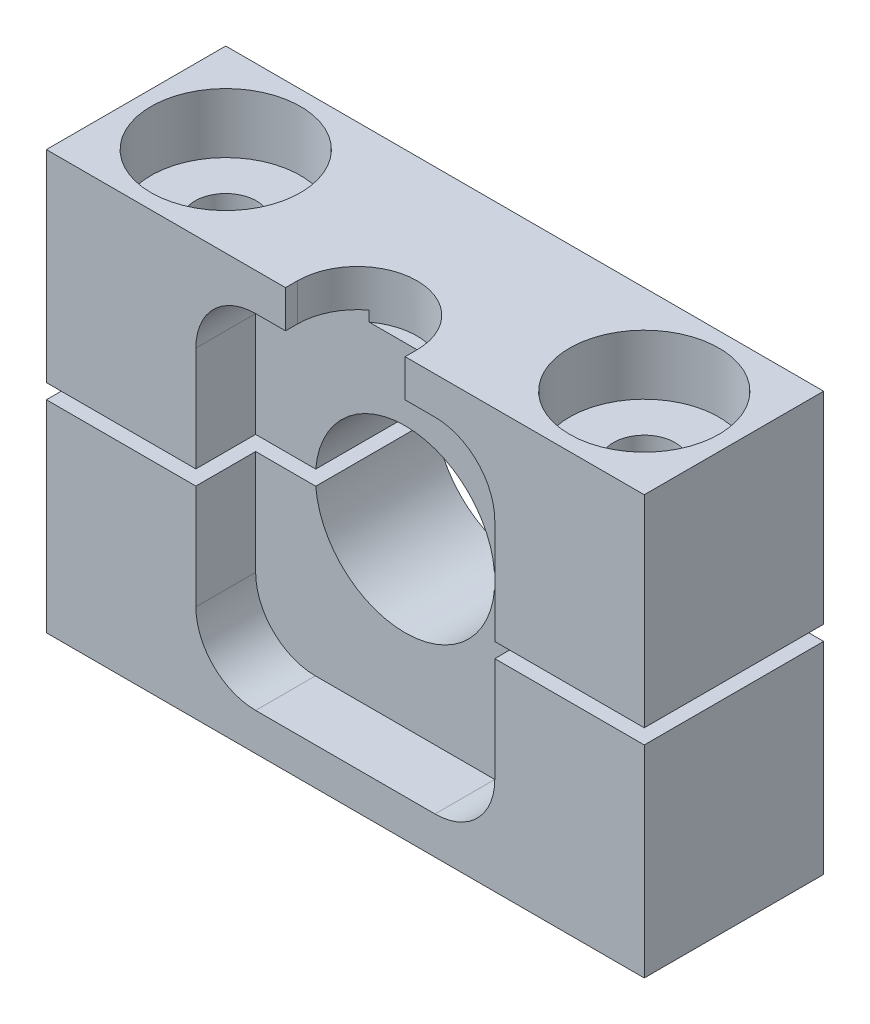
ISO-10303-21;
HEADER;
FILE_DESCRIPTION(('STEP AP214'),'2;1');
FILE_NAME('part.step','',(''),(''),'','','');
FILE_SCHEMA(('AUTOMOTIVE_DESIGN { 1 0 10303 214 1 1 1 1 }'));
ENDSEC;
DATA;
#1=APPLICATION_CONTEXT('core data for automotive mechanical design processes');
#2=APPLICATION_PROTOCOL_DEFINITION('international standard','automotive_design',2000,#1);
#3=PRODUCT_CONTEXT('',#1,'mechanical');
#4=PRODUCT('Part','Part','',(#3));
#5=PRODUCT_RELATED_PRODUCT_CATEGORY('part','',(#4));
#6=PRODUCT_DEFINITION_FORMATION('','',#4);
#7=PRODUCT_DEFINITION_CONTEXT('part definition',#1,'design');
#8=PRODUCT_DEFINITION('design','',#6,#7);
#9=PRODUCT_DEFINITION_SHAPE('','',#8);
#10=(LENGTH_UNIT() NAMED_UNIT(*) SI_UNIT(.MILLI.,.METRE.));
#11=(NAMED_UNIT(*) PLANE_ANGLE_UNIT() SI_UNIT($,.RADIAN.));
#12=(NAMED_UNIT(*) SI_UNIT($,.STERADIAN.) SOLID_ANGLE_UNIT());
#13=UNCERTAINTY_MEASURE_WITH_UNIT(LENGTH_MEASURE(1.E-05),#10,'distance_accuracy_value','');
#14=(GEOMETRIC_REPRESENTATION_CONTEXT(3) GLOBAL_UNCERTAINTY_ASSIGNED_CONTEXT((#13)) GLOBAL_UNIT_ASSIGNED_CONTEXT((#10,
#11,#12)) REPRESENTATION_CONTEXT('',''));
#15=CARTESIAN_POINT('',(0.,0.,0.));
#16=DIRECTION('',(0.,0.,1.));
#17=DIRECTION('',(1.,0.,0.));
#18=AXIS2_PLACEMENT_3D('',#15,#16,#17);
#19=CARTESIAN_POINT('',(0.,0.,9.525));
#20=DIRECTION('',(0.,0.,1.));
#21=DIRECTION('',(1.,0.,0.));
#22=AXIS2_PLACEMENT_3D('',#19,#20,#21);
#23=PLANE('',#22);
#24=DIRECTION('',(0.,1.,0.));
#25=VECTOR('',#24,1.);
#26=CARTESIAN_POINT('',(6.35,0.,9.525));
#27=LINE('',#26,#25);
#28=CARTESIAN_POINT('',(6.35,18.2499,9.525));
#29=VERTEX_POINT('',#28);
#30=CARTESIAN_POINT('',(6.35,22.225,9.525));
#31=VERTEX_POINT('',#30);
#32=EDGE_CURVE('E310',#29,#31,#27,.T.);
#33=ORIENTED_EDGE('',*,*,#32,.F.);
#34=DIRECTION('',(-1.,0.,0.));
#35=VECTOR('',#34,1.);
#36=CARTESIAN_POINT('',(-9.525,18.2499,9.525));
#37=LINE('',#36,#35);
#38=CARTESIAN_POINT('',(9.525,18.2499,9.525));
#39=VERTEX_POINT('',#38);
#40=EDGE_CURVE('E299',#39,#29,#37,.T.);
#41=ORIENTED_EDGE('',*,*,#40,.F.);
#42=CARTESIAN_POINT('',(9.525,11.8999,9.525));
#43=DIRECTION('',(0.,0.,1.));
#44=DIRECTION('',(-1.,0.,0.));
#45=AXIS2_PLACEMENT_3D('',#42,#43,#44);
#46=CIRCLE('',#45,6.35);
#47=CARTESIAN_POINT('',(15.875,11.8999,9.525));
#48=VERTEX_POINT('',#47);
#49=EDGE_CURVE('E296',#48,#39,#46,.T.);
#50=ORIENTED_EDGE('',*,*,#49,.F.);
#51=DIRECTION('',(0.,1.,0.));
#52=VECTOR('',#51,1.);
#53=CARTESIAN_POINT('',(15.875,11.8999,9.525));
#54=LINE('',#53,#52);
#55=CARTESIAN_POINT('',(15.875,0.7874,9.52499999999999));
#56=VERTEX_POINT('',#55);
#57=EDGE_CURVE('E193',#56,#48,#54,.T.);
#58=ORIENTED_EDGE('',*,*,#57,.F.);
#59=DIRECTION('',(1.,0.,0.));
#60=VECTOR('',#59,1.);
#61=CARTESIAN_POINT('',(31.75,0.7874,9.52499999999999));
#62=LINE('',#61,#60);
#63=CARTESIAN_POINT('',(31.75,0.7874,9.52499999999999));
#64=VERTEX_POINT('',#63);
#65=EDGE_CURVE('E252',#56,#64,#62,.T.);
#66=ORIENTED_EDGE('',*,*,#65,.T.);
#67=DIRECTION('',(0.,1.,0.));
#68=VECTOR('',#67,1.);
#69=CARTESIAN_POINT('',(31.75,22.225,9.525));
#70=LINE('',#69,#68);
#71=CARTESIAN_POINT('',(31.75,22.225,9.525));
#72=VERTEX_POINT('',#71);
#73=EDGE_CURVE('E158',#64,#72,#70,.T.);
#74=ORIENTED_EDGE('',*,*,#73,.T.);
#75=DIRECTION('',(-1.,0.,0.));
#76=VECTOR('',#75,1.);
#77=CARTESIAN_POINT('',(31.75,22.225,9.525));
#78=LINE('',#77,#76);
#79=EDGE_CURVE('E257',#72,#31,#78,.T.);
#80=ORIENTED_EDGE('',*,*,#79,.T.);
#81=EDGE_LOOP('',(#33,#41,#50,#58,#66,#74,#80));
#82=FACE_BOUND('',#81,.T.);
#83=ADVANCED_FACE('F43',(#82),#23,.T.);
#84=CARTESIAN_POINT('',(-9.525,18.2499,3.175));
#85=DIRECTION('',(0.,1.,0.));
#86=DIRECTION('',(0.,0.,1.));
#87=AXIS2_PLACEMENT_3D('',#84,#85,#86);
#88=PLANE('',#87);
#89=DIRECTION('',(0.,0.,-1.));
#90=VECTOR('',#89,1.);
#91=CARTESIAN_POINT('',(6.35,18.2499,3.175));
#92=LINE('',#91,#90);
#93=CARTESIAN_POINT('',(6.35,18.2499,8.255));
#94=VERTEX_POINT('',#93);
#95=EDGE_CURVE('E203',#29,#94,#92,.T.);
#96=ORIENTED_EDGE('',*,*,#95,.T.);
#97=CARTESIAN_POINT('',(0.,18.2499,8.255));
#98=DIRECTION('',(0.,1.,0.));
#99=DIRECTION('',(0.,0.,1.));
#100=AXIS2_PLACEMENT_3D('',#97,#98,#99);
#101=CIRCLE('',#100,6.35);
#102=CARTESIAN_POINT('',(3.81,18.2499,3.175));
#103=VERTEX_POINT('',#102);
#104=EDGE_CURVE('E51',#94,#103,#101,.T.);
#105=ORIENTED_EDGE('',*,*,#104,.T.);
#106=DIRECTION('',(-1.,0.,0.));
#107=VECTOR('',#106,1.);
#108=CARTESIAN_POINT('',(-9.525,18.2499,3.175));
#109=LINE('',#108,#107);
#110=CARTESIAN_POINT('',(9.525,18.2499,3.175));
#111=VERTEX_POINT('',#110);
#112=EDGE_CURVE('E214',#111,#103,#109,.T.);
#113=ORIENTED_EDGE('',*,*,#112,.F.);
#114=DIRECTION('',(0.,0.,1.));
#115=VECTOR('',#114,1.);
#116=CARTESIAN_POINT('',(9.525,18.2499,3.175));
#117=LINE('',#116,#115);
#118=EDGE_CURVE('E297',#111,#39,#117,.T.);
#119=ORIENTED_EDGE('',*,*,#118,.T.);
#120=ORIENTED_EDGE('',*,*,#40,.T.);
#121=EDGE_LOOP('',(#96,#105,#113,#119,#120));
#122=FACE_BOUND('',#121,.T.);
#123=ADVANCED_FACE('F213',(#122),#88,.F.);
#124=CARTESIAN_POINT('',(0.,0.,9.525));
#125=DIRECTION('',(0.,0.,-1.));
#126=DIRECTION('',(-1.,0.,0.));
#127=AXIS2_PLACEMENT_3D('',#124,#125,#126);
#128=CYLINDRICAL_SURFACE('',#127,9.525);
#129=CARTESIAN_POINT('',(0.,0.,3.175));
#130=DIRECTION('',(0.,0.,1.));
#131=DIRECTION('',(1.,0.,0.));
#132=AXIS2_PLACEMENT_3D('',#129,#130,#131);
#133=CIRCLE('',#132,9.525);
#134=CARTESIAN_POINT('',(9.49239833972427,0.787400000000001,3.175));
#135=VERTEX_POINT('',#134);
#136=CARTESIAN_POINT('',(-9.49239833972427,0.787400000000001,3.175));
#137=VERTEX_POINT('',#136);
#138=EDGE_CURVE('E180',#135,#137,#133,.T.);
#139=ORIENTED_EDGE('',*,*,#138,.T.);
#140=DIRECTION('',(0.,0.,-1.));
#141=VECTOR('',#140,1.);
#142=CARTESIAN_POINT('',(-9.49239833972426,0.7874,9.525));
#143=LINE('',#142,#141);
#144=CARTESIAN_POINT('',(-9.49239833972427,0.7874,-9.525));
#145=VERTEX_POINT('',#144);
#146=EDGE_CURVE('E67',#137,#145,#143,.T.);
#147=ORIENTED_EDGE('',*,*,#146,.T.);
#148=CARTESIAN_POINT('',(0.,0.,-9.525));
#149=DIRECTION('',(0.,0.,1.));
#150=DIRECTION('',(1.,0.,0.));
#151=AXIS2_PLACEMENT_3D('',#148,#149,#150);
#152=CIRCLE('',#151,9.525);
#153=CARTESIAN_POINT('',(9.49239833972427,0.7874,-9.525));
#154=VERTEX_POINT('',#153);
#155=EDGE_CURVE('E149',#154,#145,#152,.T.);
#156=ORIENTED_EDGE('',*,*,#155,.F.);
#157=DIRECTION('',(0.,0.,-1.));
#158=VECTOR('',#157,1.);
#159=CARTESIAN_POINT('',(9.49239833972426,0.7874,9.525));
#160=LINE('',#159,#158);
#161=EDGE_CURVE('E144',#154,#135,#160,.F.);
#162=ORIENTED_EDGE('',*,*,#161,.T.);
#163=EDGE_LOOP('',(#139,#147,#156,#162));
#164=FACE_BOUND('',#163,.T.);
#165=ADVANCED_FACE('F358',(#164),#128,.F.);
#166=DIRECTION('',(0.,-1.,0.));
#167=VECTOR('',#166,1.);
#168=CARTESIAN_POINT('',(-6.35,0.,9.525));
#169=LINE('',#168,#167);
#170=CARTESIAN_POINT('',(-6.35,22.225,9.525));
#171=VERTEX_POINT('',#170);
#172=CARTESIAN_POINT('',(-6.35,18.2499,9.525));
#173=VERTEX_POINT('',#172);
#174=EDGE_CURVE('E58',#171,#173,#169,.T.);
#175=ORIENTED_EDGE('',*,*,#174,.F.);
#176=CARTESIAN_POINT('',(-31.75,22.225,9.525));
#177=VERTEX_POINT('',#176);
#178=EDGE_CURVE('E254',#171,#177,#78,.T.);
#179=ORIENTED_EDGE('',*,*,#178,.T.);
#180=DIRECTION('',(0.,-1.,0.));
#181=VECTOR('',#180,1.);
#182=CARTESIAN_POINT('',(-31.75,22.225,9.525));
#183=LINE('',#182,#181);
#184=CARTESIAN_POINT('',(-31.75,0.7874,9.525));
#185=VERTEX_POINT('',#184);
#186=EDGE_CURVE('E173',#177,#185,#183,.T.);
#187=ORIENTED_EDGE('',*,*,#186,.T.);
#188=CARTESIAN_POINT('',(-15.875,0.7874,9.525));
#189=VERTEX_POINT('',#188);
#190=EDGE_CURVE('E249',#185,#189,#62,.T.);
#191=ORIENTED_EDGE('',*,*,#190,.T.);
#192=DIRECTION('',(0.,-1.,0.));
#193=VECTOR('',#192,1.);
#194=CARTESIAN_POINT('',(-15.875,11.8999,9.525));
#195=LINE('',#194,#193);
#196=CARTESIAN_POINT('',(-15.875,11.8999,9.525));
#197=VERTEX_POINT('',#196);
#198=EDGE_CURVE('E192',#197,#189,#195,.T.);
#199=ORIENTED_EDGE('',*,*,#198,.F.);
#200=CARTESIAN_POINT('',(-9.525,11.8999,9.525));
#201=DIRECTION('',(0.,0.,1.));
#202=DIRECTION('',(1.,0.,0.));
#203=AXIS2_PLACEMENT_3D('',#200,#201,#202);
#204=CIRCLE('',#203,6.35);
#205=CARTESIAN_POINT('',(-9.525,18.2499,9.525));
#206=VERTEX_POINT('',#205);
#207=EDGE_CURVE('E233',#206,#197,#204,.T.);
#208=ORIENTED_EDGE('',*,*,#207,.F.);
#209=EDGE_CURVE('E303',#173,#206,#37,.T.);
#210=ORIENTED_EDGE('',*,*,#209,.F.);
#211=EDGE_LOOP('',(#175,#179,#187,#191,#199,#208,#210));
#212=FACE_BOUND('',#211,.T.);
#213=ADVANCED_FACE('F351',(#212),#23,.T.);
#214=CARTESIAN_POINT('',(0.,0.,-9.525));
#215=DIRECTION('',(0.,0.,1.));
#216=DIRECTION('',(1.,0.,0.));
#217=AXIS2_PLACEMENT_3D('',#214,#215,#216);
#218=PLANE('',#217);
#219=DIRECTION('',(-1.,0.,0.));
#220=VECTOR('',#219,1.);
#221=CARTESIAN_POINT('',(31.75,0.7874,-9.525));
#222=LINE('',#221,#220);
#223=CARTESIAN_POINT('',(-31.75,0.7874,-9.52499999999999));
#224=VERTEX_POINT('',#223);
#225=EDGE_CURVE('E150',#145,#224,#222,.T.);
#226=ORIENTED_EDGE('',*,*,#225,.T.);
#227=DIRECTION('',(0.,-1.,0.));
#228=VECTOR('',#227,1.);
#229=CARTESIAN_POINT('',(-31.75,22.225,-9.525));
#230=LINE('',#229,#228);
#231=CARTESIAN_POINT('',(-31.75,22.225,-9.525));
#232=VERTEX_POINT('',#231);
#233=EDGE_CURVE('E159',#232,#224,#230,.T.);
#234=ORIENTED_EDGE('',*,*,#233,.F.);
#235=DIRECTION('',(-1.,0.,0.));
#236=VECTOR('',#235,1.);
#237=CARTESIAN_POINT('',(31.75,22.225,-9.525));
#238=LINE('',#237,#236);
#239=CARTESIAN_POINT('',(31.75,22.225,-9.525));
#240=VERTEX_POINT('',#239);
#241=EDGE_CURVE('E165',#240,#232,#238,.T.);
#242=ORIENTED_EDGE('',*,*,#241,.F.);
#243=DIRECTION('',(0.,1.,0.));
#244=VECTOR('',#243,1.);
#245=CARTESIAN_POINT('',(31.75,22.225,-9.525));
#246=LINE('',#245,#244);
#247=CARTESIAN_POINT('',(31.75,0.7874,-9.525));
#248=VERTEX_POINT('',#247);
#249=EDGE_CURVE('E156',#248,#240,#246,.T.);
#250=ORIENTED_EDGE('',*,*,#249,.F.);
#251=EDGE_CURVE('E137',#248,#154,#222,.T.);
#252=ORIENTED_EDGE('',*,*,#251,.T.);
#253=ORIENTED_EDGE('',*,*,#155,.T.);
#254=EDGE_LOOP('',(#226,#234,#242,#250,#252,#253));
#255=FACE_BOUND('',#254,.T.);
#256=ADVANCED_FACE('F163',(#255),#218,.F.);
#257=CARTESIAN_POINT('',(-31.75,22.225,9.525));
#258=DIRECTION('',(1.,0.,0.));
#259=DIRECTION('',(0.,0.,-1.));
#260=AXIS2_PLACEMENT_3D('',#257,#258,#259);
#261=PLANE('',#260);
#262=DIRECTION('',(0.,0.,1.));
#263=VECTOR('',#262,1.);
#264=CARTESIAN_POINT('',(-31.75,0.7874,-9.52499999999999));
#265=LINE('',#264,#263);
#266=EDGE_CURVE('E179',#224,#185,#265,.T.);
#267=ORIENTED_EDGE('',*,*,#266,.T.);
#268=ORIENTED_EDGE('',*,*,#186,.F.);
#269=DIRECTION('',(0.,0.,-1.));
#270=VECTOR('',#269,1.);
#271=CARTESIAN_POINT('',(-31.75,22.225,9.525));
#272=LINE('',#271,#270);
#273=EDGE_CURVE('E177',#177,#232,#272,.T.);
#274=ORIENTED_EDGE('',*,*,#273,.T.);
#275=ORIENTED_EDGE('',*,*,#233,.T.);
#276=EDGE_LOOP('',(#267,#268,#274,#275));
#277=FACE_BOUND('',#276,.T.);
#278=ADVANCED_FACE('F356',(#277),#261,.F.);
#279=CARTESIAN_POINT('',(31.75,22.225,9.525));
#280=DIRECTION('',(-1.,0.,0.));
#281=DIRECTION('',(0.,-1.,0.));
#282=AXIS2_PLACEMENT_3D('',#279,#280,#281);
#283=PLANE('',#282);
#284=DIRECTION('',(0.,0.,-1.));
#285=VECTOR('',#284,1.);
#286=CARTESIAN_POINT('',(31.75,0.7874,-9.525));
#287=LINE('',#286,#285);
#288=EDGE_CURVE('E141',#64,#248,#287,.T.);
#289=ORIENTED_EDGE('',*,*,#288,.T.);
#290=ORIENTED_EDGE('',*,*,#249,.T.);
#291=DIRECTION('',(0.,0.,-1.));
#292=VECTOR('',#291,1.);
#293=CARTESIAN_POINT('',(31.75,22.225,9.525));
#294=LINE('',#293,#292);
#295=EDGE_CURVE('E274',#72,#240,#294,.T.);
#296=ORIENTED_EDGE('',*,*,#295,.F.);
#297=ORIENTED_EDGE('',*,*,#73,.F.);
#298=EDGE_LOOP('',(#289,#290,#296,#297));
#299=FACE_BOUND('',#298,.T.);
#300=ADVANCED_FACE('F154',(#299),#283,.F.);
#301=CARTESIAN_POINT('',(22.225,22.225,0.));
#302=DIRECTION('',(0.,1.,0.));
#303=DIRECTION('',(0.,0.,1.));
#304=AXIS2_PLACEMENT_3D('',#301,#302,#303);
#305=CYLINDRICAL_SURFACE('',#304,3.2639);
#306=CARTESIAN_POINT('',(22.225,15.875,0.));
#307=DIRECTION('',(0.,1.,0.));
#308=DIRECTION('',(0.,0.,1.));
#309=AXIS2_PLACEMENT_3D('',#306,#307,#308);
#310=CIRCLE('',#309,3.2639);
#311=CARTESIAN_POINT('',(22.225,15.875,3.2639));
#312=VERTEX_POINT('',#311);
#313=EDGE_CURVE('E166',#312,#312,#310,.T.);
#314=ORIENTED_EDGE('',*,*,#313,.T.);
#315=EDGE_LOOP('',(#314));
#316=FACE_BOUND('',#315,.T.);
#317=CARTESIAN_POINT('',(22.225,0.787400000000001,0.));
#318=DIRECTION('',(0.,-1.,0.));
#319=DIRECTION('',(0.,0.,-1.));
#320=AXIS2_PLACEMENT_3D('',#317,#318,#319);
#321=CIRCLE('',#320,3.2639);
#322=CARTESIAN_POINT('',(22.225,0.787400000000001,-3.2639));
#323=VERTEX_POINT('',#322);
#324=EDGE_CURVE('E236',#323,#323,#321,.F.);
#325=ORIENTED_EDGE('',*,*,#324,.F.);
#326=EDGE_LOOP('',(#325));
#327=FACE_BOUND('',#326,.T.);
#328=ADVANCED_FACE('F377',(#316,#327),#305,.F.);
#329=CARTESIAN_POINT('',(-22.225,22.225,0.));
#330=DIRECTION('',(0.,1.,0.));
#331=DIRECTION('',(0.,0.,1.));
#332=AXIS2_PLACEMENT_3D('',#329,#330,#331);
#333=CYLINDRICAL_SURFACE('',#332,3.2639);
#334=CARTESIAN_POINT('',(-22.225,15.875,0.));
#335=DIRECTION('',(0.,1.,0.));
#336=DIRECTION('',(0.,0.,1.));
#337=AXIS2_PLACEMENT_3D('',#334,#335,#336);
#338=CIRCLE('',#337,3.2639);
#339=CARTESIAN_POINT('',(-22.225,15.875,3.2639));
#340=VERTEX_POINT('',#339);
#341=EDGE_CURVE('E169',#340,#340,#338,.T.);
#342=ORIENTED_EDGE('',*,*,#341,.T.);
#343=EDGE_LOOP('',(#342));
#344=FACE_BOUND('',#343,.T.);
#345=CARTESIAN_POINT('',(-22.225,0.787400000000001,0.));
#346=DIRECTION('',(0.,-1.,0.));
#347=DIRECTION('',(0.,0.,-1.));
#348=AXIS2_PLACEMENT_3D('',#345,#346,#347);
#349=CIRCLE('',#348,3.2639);
#350=CARTESIAN_POINT('',(-22.225,0.787400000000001,-3.2639));
#351=VERTEX_POINT('',#350);
#352=EDGE_CURVE('E201',#351,#351,#349,.F.);
#353=ORIENTED_EDGE('',*,*,#352,.F.);
#354=EDGE_LOOP('',(#353));
#355=FACE_BOUND('',#354,.T.);
#356=ADVANCED_FACE('F45',(#344,#355),#333,.F.);
#357=CARTESIAN_POINT('',(15.875,11.8999,3.175));
#358=DIRECTION('',(1.,0.,0.));
#359=DIRECTION('',(0.,0.,-1.));
#360=AXIS2_PLACEMENT_3D('',#357,#358,#359);
#361=PLANE('',#360);
#362=DIRECTION('',(0.,0.,-1.));
#363=VECTOR('',#362,1.);
#364=CARTESIAN_POINT('',(15.875,0.787400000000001,3.175));
#365=LINE('',#364,#363);
#366=CARTESIAN_POINT('',(15.875,0.787400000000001,3.175));
#367=VERTEX_POINT('',#366);
#368=EDGE_CURVE('E240',#56,#367,#365,.T.);
#369=ORIENTED_EDGE('',*,*,#368,.F.);
#370=ORIENTED_EDGE('',*,*,#57,.T.);
#371=DIRECTION('',(0.,0.,1.));
#372=VECTOR('',#371,1.);
#373=CARTESIAN_POINT('',(15.875,11.8999,3.175));
#374=LINE('',#373,#372);
#375=CARTESIAN_POINT('',(15.875,11.8999,3.175));
#376=VERTEX_POINT('',#375);
#377=EDGE_CURVE('E248',#376,#48,#374,.T.);
#378=ORIENTED_EDGE('',*,*,#377,.F.);
#379=DIRECTION('',(0.,1.,0.));
#380=VECTOR('',#379,1.);
#381=CARTESIAN_POINT('',(15.875,11.8999,3.175));
#382=LINE('',#381,#380);
#383=EDGE_CURVE('E184',#367,#376,#382,.T.);
#384=ORIENTED_EDGE('',*,*,#383,.F.);
#385=EDGE_LOOP('',(#369,#370,#378,#384));
#386=FACE_BOUND('',#385,.T.);
#387=ADVANCED_FACE('F266',(#386),#361,.F.);
#388=CARTESIAN_POINT('',(-15.875,11.8999,3.175));
#389=DIRECTION('',(-1.,0.,0.));
#390=DIRECTION('',(0.,0.,1.));
#391=AXIS2_PLACEMENT_3D('',#388,#389,#390);
#392=PLANE('',#391);
#393=DIRECTION('',(0.,0.,1.));
#394=VECTOR('',#393,1.);
#395=CARTESIAN_POINT('',(-15.875,0.787400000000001,3.175));
#396=LINE('',#395,#394);
#397=CARTESIAN_POINT('',(-15.875,0.787400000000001,3.175));
#398=VERTEX_POINT('',#397);
#399=EDGE_CURVE('E239',#398,#189,#396,.T.);
#400=ORIENTED_EDGE('',*,*,#399,.F.);
#401=DIRECTION('',(0.,-1.,0.));
#402=VECTOR('',#401,1.);
#403=CARTESIAN_POINT('',(-15.875,11.8999,3.175));
#404=LINE('',#403,#402);
#405=CARTESIAN_POINT('',(-15.875,11.8999,3.175));
#406=VERTEX_POINT('',#405);
#407=EDGE_CURVE('E188',#406,#398,#404,.T.);
#408=ORIENTED_EDGE('',*,*,#407,.F.);
#409=DIRECTION('',(0.,0.,1.));
#410=VECTOR('',#409,1.);
#411=CARTESIAN_POINT('',(-15.875,11.8999,3.175));
#412=LINE('',#411,#410);
#413=EDGE_CURVE('E195',#406,#197,#412,.T.);
#414=ORIENTED_EDGE('',*,*,#413,.T.);
#415=ORIENTED_EDGE('',*,*,#198,.T.);
#416=EDGE_LOOP('',(#400,#408,#414,#415));
#417=FACE_BOUND('',#416,.T.);
#418=ADVANCED_FACE('F345',(#417),#392,.F.);
#419=CARTESIAN_POINT('',(-9.525,11.8999,3.175));
#420=DIRECTION('',(0.,0.,1.));
#421=DIRECTION('',(1.,0.,0.));
#422=AXIS2_PLACEMENT_3D('',#419,#420,#421);
#423=PLANE('',#422);
#424=DIRECTION('',(0.,1.,0.));
#425=VECTOR('',#424,1.);
#426=CARTESIAN_POINT('',(3.81,17.145,3.175));
#427=LINE('',#426,#425);
#428=CARTESIAN_POINT('',(3.81,17.145,3.175));
#429=VERTEX_POINT('',#428);
#430=EDGE_CURVE('E183',#429,#103,#427,.T.);
#431=ORIENTED_EDGE('',*,*,#430,.F.);
#432=DIRECTION('',(-1.,0.,0.));
#433=VECTOR('',#432,1.);
#434=CARTESIAN_POINT('',(-9.525,17.145,3.175));
#435=LINE('',#434,#433);
#436=CARTESIAN_POINT('',(-3.81,17.145,3.175));
#437=VERTEX_POINT('',#436);
#438=EDGE_CURVE('E12',#429,#437,#435,.T.);
#439=ORIENTED_EDGE('',*,*,#438,.T.);
#440=DIRECTION('',(0.,1.,0.));
#441=VECTOR('',#440,1.);
#442=CARTESIAN_POINT('',(-3.81,17.145,3.175));
#443=LINE('',#442,#441);
#444=CARTESIAN_POINT('',(-3.81,18.2499,3.175));
#445=VERTEX_POINT('',#444);
#446=EDGE_CURVE('E327',#445,#437,#443,.F.);
#447=ORIENTED_EDGE('',*,*,#446,.F.);
#448=CARTESIAN_POINT('',(-9.525,18.2499,3.175));
#449=VERTEX_POINT('',#448);
#450=EDGE_CURVE('E227',#445,#449,#109,.T.);
#451=ORIENTED_EDGE('',*,*,#450,.T.);
#452=CARTESIAN_POINT('',(-9.525,11.8999,3.175));
#453=DIRECTION('',(0.,0.,1.));
#454=DIRECTION('',(1.,0.,0.));
#455=AXIS2_PLACEMENT_3D('',#452,#453,#454);
#456=CIRCLE('',#455,6.35);
#457=EDGE_CURVE('E226',#449,#406,#456,.T.);
#458=ORIENTED_EDGE('',*,*,#457,.T.);
#459=ORIENTED_EDGE('',*,*,#407,.T.);
#460=DIRECTION('',(1.,0.,0.));
#461=VECTOR('',#460,1.);
#462=CARTESIAN_POINT('',(-9.525,0.787400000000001,3.175));
#463=LINE('',#462,#461);
#464=EDGE_CURVE('E191',#398,#137,#463,.T.);
#465=ORIENTED_EDGE('',*,*,#464,.T.);
#466=ORIENTED_EDGE('',*,*,#138,.F.);
#467=EDGE_CURVE('E187',#135,#367,#463,.T.);
#468=ORIENTED_EDGE('',*,*,#467,.T.);
#469=ORIENTED_EDGE('',*,*,#383,.T.);
#470=CARTESIAN_POINT('',(9.525,11.8999,3.175));
#471=DIRECTION('',(0.,0.,1.));
#472=DIRECTION('',(-1.,0.,0.));
#473=AXIS2_PLACEMENT_3D('',#470,#471,#472);
#474=CIRCLE('',#473,6.35);
#475=EDGE_CURVE('E186',#376,#111,#474,.T.);
#476=ORIENTED_EDGE('',*,*,#475,.T.);
#477=ORIENTED_EDGE('',*,*,#112,.T.);
#478=EDGE_LOOP('',(#431,#439,#447,#451,#458,#459,#465,#466,#468,#469,#476,#477));
#479=FACE_BOUND('',#478,.T.);
#480=ADVANCED_FACE('F223',(#479),#423,.T.);
#481=CARTESIAN_POINT('',(31.75,22.225,9.525));
#482=DIRECTION('',(0.,-1.,0.));
#483=DIRECTION('',(1.,0.,0.));
#484=AXIS2_PLACEMENT_3D('',#481,#482,#483);
#485=PLANE('',#484);
#486=CARTESIAN_POINT('',(-22.225,22.225,0.));
#487=DIRECTION('',(0.,1.,0.));
#488=DIRECTION('',(0.,0.,1.));
#489=AXIS2_PLACEMENT_3D('',#486,#487,#488);
#490=CIRCLE('',#489,7.9375);
#491=CARTESIAN_POINT('',(-22.225,22.225,7.9375));
#492=VERTEX_POINT('',#491);
#493=EDGE_CURVE('E290',#492,#492,#490,.T.);
#494=ORIENTED_EDGE('',*,*,#493,.F.);
#495=EDGE_LOOP('',(#494));
#496=FACE_BOUND('',#495,.T.);
#497=CARTESIAN_POINT('',(22.225,22.225,0.));
#498=DIRECTION('',(0.,1.,0.));
#499=DIRECTION('',(0.,0.,1.));
#500=AXIS2_PLACEMENT_3D('',#497,#498,#499);
#501=CIRCLE('',#500,7.9375);
#502=CARTESIAN_POINT('',(22.225,22.225,7.9375));
#503=VERTEX_POINT('',#502);
#504=EDGE_CURVE('E282',#503,#503,#501,.T.);
#505=ORIENTED_EDGE('',*,*,#504,.F.);
#506=EDGE_LOOP('',(#505));
#507=FACE_BOUND('',#506,.T.);
#508=CARTESIAN_POINT('',(0.,22.225,8.255));
#509=DIRECTION('',(0.,1.,0.));
#510=DIRECTION('',(-1.,0.,0.));
#511=AXIS2_PLACEMENT_3D('',#508,#509,#510);
#512=CIRCLE('',#511,6.35);
#513=CARTESIAN_POINT('',(6.35,22.225,8.255));
#514=VERTEX_POINT('',#513);
#515=CARTESIAN_POINT('',(-6.35,22.225,8.255));
#516=VERTEX_POINT('',#515);
#517=EDGE_CURVE('E433',#514,#516,#512,.T.);
#518=ORIENTED_EDGE('',*,*,#517,.F.);
#519=DIRECTION('',(0.,0.,-1.));
#520=VECTOR('',#519,1.);
#521=CARTESIAN_POINT('',(6.35,22.225,8.255));
#522=LINE('',#521,#520);
#523=EDGE_CURVE('E425',#31,#514,#522,.T.);
#524=ORIENTED_EDGE('',*,*,#523,.F.);
#525=ORIENTED_EDGE('',*,*,#79,.F.);
#526=ORIENTED_EDGE('',*,*,#295,.T.);
#527=ORIENTED_EDGE('',*,*,#241,.T.);
#528=ORIENTED_EDGE('',*,*,#273,.F.);
#529=ORIENTED_EDGE('',*,*,#178,.F.);
#530=DIRECTION('',(0.,0.,1.));
#531=VECTOR('',#530,1.);
#532=CARTESIAN_POINT('',(-6.35,22.225,8.255));
#533=LINE('',#532,#531);
#534=EDGE_CURVE('E430',#516,#171,#533,.T.);
#535=ORIENTED_EDGE('',*,*,#534,.F.);
#536=EDGE_LOOP('',(#518,#524,#525,#526,#527,#528,#529,#535));
#537=FACE_BOUND('',#536,.T.);
#538=ADVANCED_FACE('F384',(#496,#507,#537),#485,.F.);
#539=CARTESIAN_POINT('',(25.4889,15.875,0.));
#540=DIRECTION('',(0.,-1.,0.));
#541=DIRECTION('',(0.,0.,-1.));
#542=AXIS2_PLACEMENT_3D('',#539,#540,#541);
#543=PLANE('',#542);
#544=ORIENTED_EDGE('',*,*,#313,.F.);
#545=EDGE_LOOP('',(#544));
#546=FACE_BOUND('',#545,.T.);
#547=CARTESIAN_POINT('',(22.225,15.875,0.));
#548=DIRECTION('',(0.,1.,0.));
#549=DIRECTION('',(0.,0.,1.));
#550=AXIS2_PLACEMENT_3D('',#547,#548,#549);
#551=CIRCLE('',#550,7.9375);
#552=CARTESIAN_POINT('',(22.225,15.875,7.9375));
#553=VERTEX_POINT('',#552);
#554=EDGE_CURVE('E276',#553,#553,#551,.T.);
#555=ORIENTED_EDGE('',*,*,#554,.T.);
#556=EDGE_LOOP('',(#555));
#557=FACE_BOUND('',#556,.T.);
#558=ADVANCED_FACE('F403',(#546,#557),#543,.F.);
#559=CARTESIAN_POINT('',(22.225,22.225,0.));
#560=DIRECTION('',(0.,1.,0.));
#561=DIRECTION('',(0.,0.,1.));
#562=AXIS2_PLACEMENT_3D('',#559,#560,#561);
#563=CYLINDRICAL_SURFACE('',#562,7.9375);
#564=ORIENTED_EDGE('',*,*,#554,.F.);
#565=EDGE_LOOP('',(#564));
#566=FACE_BOUND('',#565,.T.);
#567=ORIENTED_EDGE('',*,*,#504,.T.);
#568=EDGE_LOOP('',(#567));
#569=FACE_BOUND('',#568,.T.);
#570=ADVANCED_FACE('F399',(#566,#569),#563,.F.);
#571=CARTESIAN_POINT('',(-18.9611,15.875,0.));
#572=DIRECTION('',(0.,-1.,0.));
#573=DIRECTION('',(0.,0.,-1.));
#574=AXIS2_PLACEMENT_3D('',#571,#572,#573);
#575=PLANE('',#574);
#576=ORIENTED_EDGE('',*,*,#341,.F.);
#577=EDGE_LOOP('',(#576));
#578=FACE_BOUND('',#577,.T.);
#579=CARTESIAN_POINT('',(-22.225,15.875,0.));
#580=DIRECTION('',(0.,1.,0.));
#581=DIRECTION('',(0.,0.,1.));
#582=AXIS2_PLACEMENT_3D('',#579,#580,#581);
#583=CIRCLE('',#582,7.9375);
#584=CARTESIAN_POINT('',(-22.225,15.875,7.9375));
#585=VERTEX_POINT('',#584);
#586=EDGE_CURVE('E285',#585,#585,#583,.T.);
#587=ORIENTED_EDGE('',*,*,#586,.T.);
#588=EDGE_LOOP('',(#587));
#589=FACE_BOUND('',#588,.T.);
#590=ADVANCED_FACE('F395',(#578,#589),#575,.F.);
#591=CARTESIAN_POINT('',(-22.225,22.225,0.));
#592=DIRECTION('',(0.,1.,0.));
#593=DIRECTION('',(0.,0.,1.));
#594=AXIS2_PLACEMENT_3D('',#591,#592,#593);
#595=CYLINDRICAL_SURFACE('',#594,7.9375);
#596=ORIENTED_EDGE('',*,*,#586,.F.);
#597=EDGE_LOOP('',(#596));
#598=FACE_BOUND('',#597,.T.);
#599=ORIENTED_EDGE('',*,*,#493,.T.);
#600=EDGE_LOOP('',(#599));
#601=FACE_BOUND('',#600,.T.);
#602=ADVANCED_FACE('F392',(#598,#601),#595,.F.);
#603=CARTESIAN_POINT('',(-9.525,11.8999,3.175));
#604=DIRECTION('',(0.,0.,1.));
#605=DIRECTION('',(1.,0.,0.));
#606=AXIS2_PLACEMENT_3D('',#603,#604,#605);
#607=CYLINDRICAL_SURFACE('',#606,6.35);
#608=ORIENTED_EDGE('',*,*,#207,.T.);
#609=ORIENTED_EDGE('',*,*,#413,.F.);
#610=ORIENTED_EDGE('',*,*,#457,.F.);
#611=DIRECTION('',(0.,0.,1.));
#612=VECTOR('',#611,1.);
#613=CARTESIAN_POINT('',(-9.525,18.2499,3.175));
#614=LINE('',#613,#612);
#615=EDGE_CURVE('E300',#449,#206,#614,.T.);
#616=ORIENTED_EDGE('',*,*,#615,.T.);
#617=EDGE_LOOP('',(#608,#609,#610,#616));
#618=FACE_BOUND('',#617,.T.);
#619=ADVANCED_FACE('F341',(#618),#607,.F.);
#620=ORIENTED_EDGE('',*,*,#450,.F.);
#621=CARTESIAN_POINT('',(-6.35,18.2499,8.255));
#622=VERTEX_POINT('',#621);
#623=EDGE_CURVE('E200',#445,#622,#101,.T.);
#624=ORIENTED_EDGE('',*,*,#623,.T.);
#625=DIRECTION('',(0.,0.,1.));
#626=VECTOR('',#625,1.);
#627=CARTESIAN_POINT('',(-6.35,18.2499,3.175));
#628=LINE('',#627,#626);
#629=EDGE_CURVE('E198',#622,#173,#628,.T.);
#630=ORIENTED_EDGE('',*,*,#629,.T.);
#631=ORIENTED_EDGE('',*,*,#209,.T.);
#632=ORIENTED_EDGE('',*,*,#615,.F.);
#633=EDGE_LOOP('',(#620,#624,#630,#631,#632));
#634=FACE_BOUND('',#633,.T.);
#635=ADVANCED_FACE('F336',(#634),#88,.F.);
#636=CARTESIAN_POINT('',(9.525,11.8999,3.175));
#637=DIRECTION('',(0.,0.,1.));
#638=DIRECTION('',(1.,0.,0.));
#639=AXIS2_PLACEMENT_3D('',#636,#637,#638);
#640=CYLINDRICAL_SURFACE('',#639,6.35);
#641=ORIENTED_EDGE('',*,*,#49,.T.);
#642=ORIENTED_EDGE('',*,*,#118,.F.);
#643=ORIENTED_EDGE('',*,*,#475,.F.);
#644=ORIENTED_EDGE('',*,*,#377,.T.);
#645=EDGE_LOOP('',(#641,#642,#643,#644));
#646=FACE_BOUND('',#645,.T.);
#647=ADVANCED_FACE('F307',(#646),#640,.F.);
#648=CARTESIAN_POINT('',(0.,0.7874,0.));
#649=DIRECTION('',(0.,-1.,0.));
#650=DIRECTION('',(0.,0.,-1.));
#651=AXIS2_PLACEMENT_3D('',#648,#649,#650);
#652=PLANE('',#651);
#653=ORIENTED_EDGE('',*,*,#251,.F.);
#654=ORIENTED_EDGE('',*,*,#288,.F.);
#655=ORIENTED_EDGE('',*,*,#65,.F.);
#656=ORIENTED_EDGE('',*,*,#368,.T.);
#657=ORIENTED_EDGE('',*,*,#467,.F.);
#658=ORIENTED_EDGE('',*,*,#161,.F.);
#659=EDGE_LOOP('',(#653,#654,#655,#656,#657,#658));
#660=FACE_BOUND('',#659,.T.);
#661=ORIENTED_EDGE('',*,*,#324,.T.);
#662=EDGE_LOOP('',(#661));
#663=FACE_BOUND('',#662,.T.);
#664=ADVANCED_FACE('F139',(#660,#663),#652,.T.);
#665=ORIENTED_EDGE('',*,*,#464,.F.);
#666=ORIENTED_EDGE('',*,*,#399,.T.);
#667=ORIENTED_EDGE('',*,*,#190,.F.);
#668=ORIENTED_EDGE('',*,*,#266,.F.);
#669=ORIENTED_EDGE('',*,*,#225,.F.);
#670=ORIENTED_EDGE('',*,*,#146,.F.);
#671=EDGE_LOOP('',(#665,#666,#667,#668,#669,#670));
#672=FACE_BOUND('',#671,.T.);
#673=ORIENTED_EDGE('',*,*,#352,.T.);
#674=EDGE_LOOP('',(#673));
#675=FACE_BOUND('',#674,.T.);
#676=ADVANCED_FACE('F347',(#672,#675),#652,.T.);
#677=CARTESIAN_POINT('',(0.,17.145,8.255));
#678=DIRECTION('',(0.,1.,0.));
#679=DIRECTION('',(-1.,0.,0.));
#680=AXIS2_PLACEMENT_3D('',#677,#678,#679);
#681=CYLINDRICAL_SURFACE('',#680,6.35);
#682=ORIENTED_EDGE('',*,*,#430,.T.);
#683=ORIENTED_EDGE('',*,*,#104,.F.);
#684=DIRECTION('',(0.,1.,0.));
#685=VECTOR('',#684,1.);
#686=CARTESIAN_POINT('',(6.35,17.145,8.255));
#687=LINE('',#686,#685);
#688=EDGE_CURVE('E427',#94,#514,#687,.T.);
#689=ORIENTED_EDGE('',*,*,#688,.T.);
#690=ORIENTED_EDGE('',*,*,#517,.T.);
#691=DIRECTION('',(0.,1.,0.));
#692=VECTOR('',#691,1.);
#693=CARTESIAN_POINT('',(-6.35,17.145,8.255));
#694=LINE('',#693,#692);
#695=EDGE_CURVE('E332',#622,#516,#694,.T.);
#696=ORIENTED_EDGE('',*,*,#695,.F.);
#697=ORIENTED_EDGE('',*,*,#623,.F.);
#698=ORIENTED_EDGE('',*,*,#446,.T.);
#699=CARTESIAN_POINT('',(0.,17.145,8.255));
#700=DIRECTION('',(0.,1.,0.));
#701=DIRECTION('',(-1.,0.,0.));
#702=AXIS2_PLACEMENT_3D('',#699,#700,#701);
#703=CIRCLE('',#702,6.35);
#704=EDGE_CURVE('E424',#429,#437,#703,.T.);
#705=ORIENTED_EDGE('',*,*,#704,.F.);
#706=EDGE_LOOP('',(#682,#683,#689,#690,#696,#697,#698,#705));
#707=FACE_BOUND('',#706,.T.);
#708=ADVANCED_FACE('F325',(#707),#681,.F.);
#709=CARTESIAN_POINT('',(6.35,17.145,8.255));
#710=DIRECTION('',(1.,0.,0.));
#711=DIRECTION('',(0.,1.,0.));
#712=AXIS2_PLACEMENT_3D('',#709,#710,#711);
#713=PLANE('',#712);
#714=ORIENTED_EDGE('',*,*,#32,.T.);
#715=ORIENTED_EDGE('',*,*,#523,.T.);
#716=ORIENTED_EDGE('',*,*,#688,.F.);
#717=ORIENTED_EDGE('',*,*,#95,.F.);
#718=EDGE_LOOP('',(#714,#715,#716,#717));
#719=FACE_BOUND('',#718,.T.);
#720=ADVANCED_FACE('F413',(#719),#713,.F.);
#721=CARTESIAN_POINT('',(-6.35,17.145,8.255));
#722=DIRECTION('',(-1.,0.,0.));
#723=DIRECTION('',(0.,0.,1.));
#724=AXIS2_PLACEMENT_3D('',#721,#722,#723);
#725=PLANE('',#724);
#726=ORIENTED_EDGE('',*,*,#174,.T.);
#727=ORIENTED_EDGE('',*,*,#629,.F.);
#728=ORIENTED_EDGE('',*,*,#695,.T.);
#729=ORIENTED_EDGE('',*,*,#534,.T.);
#730=EDGE_LOOP('',(#726,#727,#728,#729));
#731=FACE_BOUND('',#730,.T.);
#732=ADVANCED_FACE('F414',(#731),#725,.F.);
#733=CARTESIAN_POINT('',(0.,17.145,8.255));
#734=DIRECTION('',(0.,1.,0.));
#735=DIRECTION('',(-1.,0.,0.));
#736=AXIS2_PLACEMENT_3D('',#733,#734,#735);
#737=PLANE('',#736);
#738=ORIENTED_EDGE('',*,*,#704,.T.);
#739=ORIENTED_EDGE('',*,*,#438,.F.);
#740=EDGE_LOOP('',(#738,#739));
#741=FACE_BOUND('',#740,.T.);
#742=ADVANCED_FACE('F417',(#741),#737,.T.);
#743=CLOSED_SHELL('',(#83,#123,#165,#213,#256,#278,#300,#328,#356,#387,#418,#480,#538,#558,#570,
#590,#602,#619,#635,#647,#664,#676,#708,#720,#732,#742));
#744=MANIFOLD_SOLID_BREP('B2',#743);
#745=CARTESIAN_POINT('',(9.525,-11.8999,3.175));
#746=DIRECTION('',(0.,0.,1.));
#747=DIRECTION('',(1.,0.,0.));
#748=AXIS2_PLACEMENT_3D('',#745,#746,#747);
#749=CYLINDRICAL_SURFACE('',#748,6.35);
#750=CARTESIAN_POINT('',(9.525,-11.8999,9.525));
#751=DIRECTION('',(0.,0.,1.));
#752=DIRECTION('',(1.,0.,0.));
#753=AXIS2_PLACEMENT_3D('',#750,#751,#752);
#754=CIRCLE('',#753,6.35);
#755=CARTESIAN_POINT('',(9.525,-18.2499,9.525));
#756=VERTEX_POINT('',#755);
#757=CARTESIAN_POINT('',(15.875,-11.8999,9.525));
#758=VERTEX_POINT('',#757);
#759=EDGE_CURVE('E831',#756,#758,#754,.T.);
#760=ORIENTED_EDGE('',*,*,#759,.T.);
#761=DIRECTION('',(0.,0.,1.));
#762=VECTOR('',#761,1.);
#763=CARTESIAN_POINT('',(15.875,-11.8999,3.175));
#764=LINE('',#763,#762);
#765=CARTESIAN_POINT('',(15.875,-11.8999,3.175));
#766=VERTEX_POINT('',#765);
#767=EDGE_CURVE('E754',#766,#758,#764,.T.);
#768=ORIENTED_EDGE('',*,*,#767,.F.);
#769=CARTESIAN_POINT('',(9.525,-11.8999,3.175));
#770=DIRECTION('',(0.,0.,1.));
#771=DIRECTION('',(1.,0.,0.));
#772=AXIS2_PLACEMENT_3D('',#769,#770,#771);
#773=CIRCLE('',#772,6.35);
#774=CARTESIAN_POINT('',(9.525,-18.2499,3.175));
#775=VERTEX_POINT('',#774);
#776=EDGE_CURVE('E820',#775,#766,#773,.T.);
#777=ORIENTED_EDGE('',*,*,#776,.F.);
#778=DIRECTION('',(0.,0.,1.));
#779=VECTOR('',#778,1.);
#780=CARTESIAN_POINT('',(9.525,-18.2499,3.175));
#781=LINE('',#780,#779);
#782=EDGE_CURVE('E761',#775,#756,#781,.T.);
#783=ORIENTED_EDGE('',*,*,#782,.T.);
#784=EDGE_LOOP('',(#760,#768,#777,#783));
#785=FACE_BOUND('',#784,.T.);
#786=ADVANCED_FACE('F623',(#785),#749,.F.);
#787=CARTESIAN_POINT('',(-9.525,-18.2499,3.175));
#788=DIRECTION('',(0.,-1.,0.));
#789=DIRECTION('',(0.,0.,-1.));
#790=AXIS2_PLACEMENT_3D('',#787,#788,#789);
#791=PLANE('',#790);
#792=DIRECTION('',(1.,0.,0.));
#793=VECTOR('',#792,1.);
#794=CARTESIAN_POINT('',(-9.525,-18.2499,9.525));
#795=LINE('',#794,#793);
#796=CARTESIAN_POINT('',(-9.525,-18.2499,9.525));
#797=VERTEX_POINT('',#796);
#798=EDGE_CURVE('E829',#797,#756,#795,.T.);
#799=ORIENTED_EDGE('',*,*,#798,.T.);
#800=ORIENTED_EDGE('',*,*,#782,.F.);
#801=DIRECTION('',(1.,0.,0.));
#802=VECTOR('',#801,1.);
#803=CARTESIAN_POINT('',(-9.525,-18.2499,3.175));
#804=LINE('',#803,#802);
#805=CARTESIAN_POINT('',(-9.525,-18.2499,3.175));
#806=VERTEX_POINT('',#805);
#807=EDGE_CURVE('E817',#806,#775,#804,.T.);
#808=ORIENTED_EDGE('',*,*,#807,.F.);
#809=DIRECTION('',(0.,0.,1.));
#810=VECTOR('',#809,1.);
#811=CARTESIAN_POINT('',(-9.525,-18.2499,3.175));
#812=LINE('',#811,#810);
#813=EDGE_CURVE('E767',#806,#797,#812,.T.);
#814=ORIENTED_EDGE('',*,*,#813,.T.);
#815=EDGE_LOOP('',(#799,#800,#808,#814));
#816=FACE_BOUND('',#815,.T.);
#817=ADVANCED_FACE('F838',(#816),#791,.F.);
#818=CARTESIAN_POINT('',(-9.525,-11.8999,3.175));
#819=DIRECTION('',(0.,0.,1.));
#820=DIRECTION('',(1.,0.,0.));
#821=AXIS2_PLACEMENT_3D('',#818,#819,#820);
#822=CYLINDRICAL_SURFACE('',#821,6.35);
#823=CARTESIAN_POINT('',(-9.525,-11.8999,9.525));
#824=DIRECTION('',(0.,0.,1.));
#825=DIRECTION('',(1.,0.,0.));
#826=AXIS2_PLACEMENT_3D('',#823,#824,#825);
#827=CIRCLE('',#826,6.35);
#828=CARTESIAN_POINT('',(-15.875,-11.8999,9.525));
#829=VERTEX_POINT('',#828);
#830=EDGE_CURVE('E826',#829,#797,#827,.T.);
#831=ORIENTED_EDGE('',*,*,#830,.T.);
#832=ORIENTED_EDGE('',*,*,#813,.F.);
#833=CARTESIAN_POINT('',(-9.525,-11.8999,3.175));
#834=DIRECTION('',(0.,0.,1.));
#835=DIRECTION('',(1.,0.,0.));
#836=AXIS2_PLACEMENT_3D('',#833,#834,#835);
#837=CIRCLE('',#836,6.35);
#838=CARTESIAN_POINT('',(-15.875,-11.8999,3.175));
#839=VERTEX_POINT('',#838);
#840=EDGE_CURVE('E814',#839,#806,#837,.T.);
#841=ORIENTED_EDGE('',*,*,#840,.F.);
#842=DIRECTION('',(0.,0.,1.));
#843=VECTOR('',#842,1.);
#844=CARTESIAN_POINT('',(-15.875,-11.8999,3.175));
#845=LINE('',#844,#843);
#846=EDGE_CURVE('E774',#839,#829,#845,.T.);
#847=ORIENTED_EDGE('',*,*,#846,.T.);
#848=EDGE_LOOP('',(#831,#832,#841,#847));
#849=FACE_BOUND('',#848,.T.);
#850=ADVANCED_FACE('F843',(#849),#822,.F.);
#851=CARTESIAN_POINT('',(-9.525,11.8999,3.175));
#852=DIRECTION('',(0.,0.,1.));
#853=DIRECTION('',(1.,0.,0.));
#854=AXIS2_PLACEMENT_3D('',#851,#852,#853);
#855=PLANE('',#854);
#856=DIRECTION('',(1.,0.,0.));
#857=VECTOR('',#856,1.);
#858=CARTESIAN_POINT('',(-9.525,-0.787400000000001,3.175));
#859=LINE('',#858,#857);
#860=CARTESIAN_POINT('',(-15.875,-0.787400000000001,3.175));
#861=VERTEX_POINT('',#860);
#862=CARTESIAN_POINT('',(-9.49239833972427,-0.787400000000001,3.175));
#863=VERTEX_POINT('',#862);
#864=EDGE_CURVE('E41',#861,#863,#859,.T.);
#865=ORIENTED_EDGE('',*,*,#864,.F.);
#866=DIRECTION('',(0.,-1.,0.));
#867=VECTOR('',#866,1.);
#868=CARTESIAN_POINT('',(-15.875,11.8999,3.175));
#869=LINE('',#868,#867);
#870=EDGE_CURVE('E812',#861,#839,#869,.T.);
#871=ORIENTED_EDGE('',*,*,#870,.T.);
#872=ORIENTED_EDGE('',*,*,#840,.T.);
#873=ORIENTED_EDGE('',*,*,#807,.T.);
#874=ORIENTED_EDGE('',*,*,#776,.T.);
#875=DIRECTION('',(0.,1.,0.));
#876=VECTOR('',#875,1.);
#877=CARTESIAN_POINT('',(15.875,11.8999,3.175));
#878=LINE('',#877,#876);
#879=CARTESIAN_POINT('',(15.875,-0.787400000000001,3.175));
#880=VERTEX_POINT('',#879);
#881=EDGE_CURVE('E776',#766,#880,#878,.T.);
#882=ORIENTED_EDGE('',*,*,#881,.T.);
#883=CARTESIAN_POINT('',(9.49239833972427,-0.787400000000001,3.175));
#884=VERTEX_POINT('',#883);
#885=EDGE_CURVE('E627',#884,#880,#859,.T.);
#886=ORIENTED_EDGE('',*,*,#885,.F.);
#887=CARTESIAN_POINT('',(0.,0.,3.175));
#888=DIRECTION('',(0.,0.,1.));
#889=DIRECTION('',(1.,0.,0.));
#890=AXIS2_PLACEMENT_3D('',#887,#888,#889);
#891=CIRCLE('',#890,9.525);
#892=EDGE_CURVE('E751',#863,#884,#891,.T.);
#893=ORIENTED_EDGE('',*,*,#892,.F.);
#894=EDGE_LOOP('',(#865,#871,#872,#873,#874,#882,#886,#893));
#895=FACE_BOUND('',#894,.T.);
#896=ADVANCED_FACE('F849',(#895),#855,.T.);
#897=CARTESIAN_POINT('',(-15.875,11.8999,3.175));
#898=DIRECTION('',(-1.,0.,0.));
#899=DIRECTION('',(0.,0.,1.));
#900=AXIS2_PLACEMENT_3D('',#897,#898,#899);
#901=PLANE('',#900);
#902=ORIENTED_EDGE('',*,*,#870,.F.);
#903=DIRECTION('',(0.,0.,1.));
#904=VECTOR('',#903,1.);
#905=CARTESIAN_POINT('',(-15.875,-0.787400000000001,3.175));
#906=LINE('',#905,#904);
#907=CARTESIAN_POINT('',(-15.875,-0.7874,9.525));
#908=VERTEX_POINT('',#907);
#909=EDGE_CURVE('E637',#861,#908,#906,.T.);
#910=ORIENTED_EDGE('',*,*,#909,.T.);
#911=DIRECTION('',(0.,-1.,0.));
#912=VECTOR('',#911,1.);
#913=CARTESIAN_POINT('',(-15.875,11.8999,9.525));
#914=LINE('',#913,#912);
#915=EDGE_CURVE('E795',#908,#829,#914,.T.);
#916=ORIENTED_EDGE('',*,*,#915,.T.);
#917=ORIENTED_EDGE('',*,*,#846,.F.);
#918=EDGE_LOOP('',(#902,#910,#916,#917));
#919=FACE_BOUND('',#918,.T.);
#920=ADVANCED_FACE('F847',(#919),#901,.F.);
#921=CARTESIAN_POINT('',(15.875,11.8999,3.175));
#922=DIRECTION('',(1.,0.,0.));
#923=DIRECTION('',(0.,0.,-1.));
#924=AXIS2_PLACEMENT_3D('',#921,#922,#923);
#925=PLANE('',#924);
#926=DIRECTION('',(0.,1.,0.));
#927=VECTOR('',#926,1.);
#928=CARTESIAN_POINT('',(15.875,11.8999,9.525));
#929=LINE('',#928,#927);
#930=CARTESIAN_POINT('',(15.875,-0.7874,9.52499999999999));
#931=VERTEX_POINT('',#930);
#932=EDGE_CURVE('E770',#758,#931,#929,.T.);
#933=ORIENTED_EDGE('',*,*,#932,.T.);
#934=DIRECTION('',(0.,0.,-1.));
#935=VECTOR('',#934,1.);
#936=CARTESIAN_POINT('',(15.875,-0.787400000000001,3.175));
#937=LINE('',#936,#935);
#938=EDGE_CURVE('E796',#931,#880,#937,.T.);
#939=ORIENTED_EDGE('',*,*,#938,.T.);
#940=ORIENTED_EDGE('',*,*,#881,.F.);
#941=ORIENTED_EDGE('',*,*,#767,.T.);
#942=EDGE_LOOP('',(#933,#939,#940,#941));
#943=FACE_BOUND('',#942,.T.);
#944=ADVANCED_FACE('F835',(#943),#925,.F.);
#945=CARTESIAN_POINT('',(31.75,22.225,9.525));
#946=DIRECTION('',(-1.,0.,0.));
#947=DIRECTION('',(0.,-1.,0.));
#948=AXIS2_PLACEMENT_3D('',#945,#946,#947);
#949=PLANE('',#948);
#950=DIRECTION('',(0.,1.,0.));
#951=VECTOR('',#950,1.);
#952=CARTESIAN_POINT('',(31.75,22.225,-9.525));
#953=LINE('',#952,#951);
#954=CARTESIAN_POINT('',(31.75,-22.225,-9.525));
#955=VERTEX_POINT('',#954);
#956=CARTESIAN_POINT('',(31.75,-0.7874,-9.525));
#957=VERTEX_POINT('',#956);
#958=EDGE_CURVE('E728',#955,#957,#953,.T.);
#959=ORIENTED_EDGE('',*,*,#958,.T.);
#960=DIRECTION('',(0.,0.,-1.));
#961=VECTOR('',#960,1.);
#962=CARTESIAN_POINT('',(31.75,-0.7874,-9.525));
#963=LINE('',#962,#961);
#964=CARTESIAN_POINT('',(31.75,-0.7874,9.52499999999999));
#965=VERTEX_POINT('',#964);
#966=EDGE_CURVE('E709',#965,#957,#963,.T.);
#967=ORIENTED_EDGE('',*,*,#966,.F.);
#968=DIRECTION('',(0.,1.,0.));
#969=VECTOR('',#968,1.);
#970=CARTESIAN_POINT('',(31.75,22.225,9.525));
#971=LINE('',#970,#969);
#972=CARTESIAN_POINT('',(31.75,-22.225,9.525));
#973=VERTEX_POINT('',#972);
#974=EDGE_CURVE('E749',#973,#965,#971,.T.);
#975=ORIENTED_EDGE('',*,*,#974,.F.);
#976=DIRECTION('',(0.,0.,-1.));
#977=VECTOR('',#976,1.);
#978=CARTESIAN_POINT('',(31.75,-22.225,9.525));
#979=LINE('',#978,#977);
#980=EDGE_CURVE('E737',#973,#955,#979,.T.);
#981=ORIENTED_EDGE('',*,*,#980,.T.);
#982=EDGE_LOOP('',(#959,#967,#975,#981));
#983=FACE_BOUND('',#982,.T.);
#984=ADVANCED_FACE('F735',(#983),#949,.F.);
#985=CARTESIAN_POINT('',(-31.75,22.225,9.525));
#986=DIRECTION('',(1.,0.,0.));
#987=DIRECTION('',(0.,0.,-1.));
#988=AXIS2_PLACEMENT_3D('',#985,#986,#987);
#989=PLANE('',#988);
#990=DIRECTION('',(0.,-1.,0.));
#991=VECTOR('',#990,1.);
#992=CARTESIAN_POINT('',(-31.75,22.225,9.525));
#993=LINE('',#992,#991);
#994=CARTESIAN_POINT('',(-31.75,-0.7874,9.525));
#995=VERTEX_POINT('',#994);
#996=CARTESIAN_POINT('',(-31.75,-22.225,9.525));
#997=VERTEX_POINT('',#996);
#998=EDGE_CURVE('E738',#995,#997,#993,.T.);
#999=ORIENTED_EDGE('',*,*,#998,.F.);
#1000=DIRECTION('',(0.,0.,1.));
#1001=VECTOR('',#1000,1.);
#1002=CARTESIAN_POINT('',(-31.75,-0.7874,-9.52499999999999));
#1003=LINE('',#1002,#1001);
#1004=CARTESIAN_POINT('',(-31.75,-0.7874,-9.52499999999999));
#1005=VERTEX_POINT('',#1004);
#1006=EDGE_CURVE('E732',#1005,#995,#1003,.T.);
#1007=ORIENTED_EDGE('',*,*,#1006,.F.);
#1008=DIRECTION('',(0.,-1.,0.));
#1009=VECTOR('',#1008,1.);
#1010=CARTESIAN_POINT('',(-31.75,22.225,-9.525));
#1011=LINE('',#1010,#1009);
#1012=CARTESIAN_POINT('',(-31.75,-22.225,-9.525));
#1013=VERTEX_POINT('',#1012);
#1014=EDGE_CURVE('E743',#1005,#1013,#1011,.T.);
#1015=ORIENTED_EDGE('',*,*,#1014,.T.);
#1016=DIRECTION('',(0.,0.,-1.));
#1017=VECTOR('',#1016,1.);
#1018=CARTESIAN_POINT('',(-31.75,-22.225,9.525));
#1019=LINE('',#1018,#1017);
#1020=EDGE_CURVE('E748',#997,#1013,#1019,.T.);
#1021=ORIENTED_EDGE('',*,*,#1020,.F.);
#1022=EDGE_LOOP('',(#999,#1007,#1015,#1021));
#1023=FACE_BOUND('',#1022,.T.);
#1024=ADVANCED_FACE('F625',(#1023),#989,.F.);
#1025=CARTESIAN_POINT('',(0.,0.,-9.525));
#1026=DIRECTION('',(0.,0.,1.));
#1027=DIRECTION('',(1.,0.,0.));
#1028=AXIS2_PLACEMENT_3D('',#1025,#1026,#1027);
#1029=PLANE('',#1028);
#1030=ORIENTED_EDGE('',*,*,#1014,.F.);
#1031=DIRECTION('',(-1.,0.,0.));
#1032=VECTOR('',#1031,1.);
#1033=CARTESIAN_POINT('',(31.75,-0.7874,-9.525));
#1034=LINE('',#1033,#1032);
#1035=CARTESIAN_POINT('',(-9.49239833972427,-0.7874,-9.525));
#1036=VERTEX_POINT('',#1035);
#1037=EDGE_CURVE('E720',#1036,#1005,#1034,.T.);
#1038=ORIENTED_EDGE('',*,*,#1037,.F.);
#1039=CARTESIAN_POINT('',(0.,0.,-9.525));
#1040=DIRECTION('',(0.,0.,1.));
#1041=DIRECTION('',(1.,0.,0.));
#1042=AXIS2_PLACEMENT_3D('',#1039,#1040,#1041);
#1043=CIRCLE('',#1042,9.525);
#1044=CARTESIAN_POINT('',(9.49239833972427,-0.7874,-9.525));
#1045=VERTEX_POINT('',#1044);
#1046=EDGE_CURVE('E731',#1036,#1045,#1043,.T.);
#1047=ORIENTED_EDGE('',*,*,#1046,.T.);
#1048=EDGE_CURVE('E713',#957,#1045,#1034,.T.);
#1049=ORIENTED_EDGE('',*,*,#1048,.F.);
#1050=ORIENTED_EDGE('',*,*,#958,.F.);
#1051=DIRECTION('',(1.,0.,0.));
#1052=VECTOR('',#1051,1.);
#1053=CARTESIAN_POINT('',(31.75,-22.225,-9.525));
#1054=LINE('',#1053,#1052);
#1055=EDGE_CURVE('E739',#1013,#955,#1054,.T.);
#1056=ORIENTED_EDGE('',*,*,#1055,.F.);
#1057=EDGE_LOOP('',(#1030,#1038,#1047,#1049,#1050,#1056));
#1058=FACE_BOUND('',#1057,.T.);
#1059=ADVANCED_FACE('F726',(#1058),#1029,.F.);
#1060=CARTESIAN_POINT('',(0.,0.,9.525));
#1061=DIRECTION('',(0.,0.,1.));
#1062=DIRECTION('',(1.,0.,0.));
#1063=AXIS2_PLACEMENT_3D('',#1060,#1061,#1062);
#1064=PLANE('',#1063);
#1065=DIRECTION('',(1.,0.,0.));
#1066=VECTOR('',#1065,1.);
#1067=CARTESIAN_POINT('',(31.75,-0.7874,9.52499999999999));
#1068=LINE('',#1067,#1066);
#1069=EDGE_CURVE('E793',#995,#908,#1068,.T.);
#1070=ORIENTED_EDGE('',*,*,#1069,.F.);
#1071=ORIENTED_EDGE('',*,*,#998,.T.);
#1072=DIRECTION('',(1.,0.,0.));
#1073=VECTOR('',#1072,1.);
#1074=CARTESIAN_POINT('',(-31.75,-22.225,9.525));
#1075=LINE('',#1074,#1073);
#1076=EDGE_CURVE('E741',#997,#973,#1075,.T.);
#1077=ORIENTED_EDGE('',*,*,#1076,.T.);
#1078=ORIENTED_EDGE('',*,*,#974,.T.);
#1079=EDGE_CURVE('E715',#931,#965,#1068,.T.);
#1080=ORIENTED_EDGE('',*,*,#1079,.F.);
#1081=ORIENTED_EDGE('',*,*,#932,.F.);
#1082=ORIENTED_EDGE('',*,*,#759,.F.);
#1083=ORIENTED_EDGE('',*,*,#798,.F.);
#1084=ORIENTED_EDGE('',*,*,#830,.F.);
#1085=ORIENTED_EDGE('',*,*,#915,.F.);
#1086=EDGE_LOOP('',(#1070,#1071,#1077,#1078,#1080,#1081,#1082,#1083,#1084,#1085));
#1087=FACE_BOUND('',#1086,.T.);
#1088=ADVANCED_FACE('F791',(#1087),#1064,.T.);
#1089=CARTESIAN_POINT('',(0.,0.,9.525));
#1090=DIRECTION('',(0.,0.,-1.));
#1091=DIRECTION('',(-1.,0.,0.));
#1092=AXIS2_PLACEMENT_3D('',#1089,#1090,#1091);
#1093=CYLINDRICAL_SURFACE('',#1092,9.525);
#1094=DIRECTION('',(0.,0.,-1.));
#1095=VECTOR('',#1094,1.);
#1096=CARTESIAN_POINT('',(-9.49239833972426,-0.7874,9.525));
#1097=LINE('',#1096,#1095);
#1098=EDGE_CURVE('E804',#863,#1036,#1097,.T.);
#1099=ORIENTED_EDGE('',*,*,#1098,.F.);
#1100=ORIENTED_EDGE('',*,*,#892,.T.);
#1101=DIRECTION('',(0.,0.,-1.));
#1102=VECTOR('',#1101,1.);
#1103=CARTESIAN_POINT('',(9.49239833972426,-0.7874,9.525));
#1104=LINE('',#1103,#1102);
#1105=EDGE_CURVE('E645',#1045,#884,#1104,.F.);
#1106=ORIENTED_EDGE('',*,*,#1105,.F.);
#1107=ORIENTED_EDGE('',*,*,#1046,.F.);
#1108=EDGE_LOOP('',(#1099,#1100,#1106,#1107));
#1109=FACE_BOUND('',#1108,.T.);
#1110=ADVANCED_FACE('F852',(#1109),#1093,.F.);
#1111=CARTESIAN_POINT('',(22.225,22.225,0.));
#1112=DIRECTION('',(0.,1.,0.));
#1113=DIRECTION('',(0.,0.,1.));
#1114=AXIS2_PLACEMENT_3D('',#1111,#1112,#1113);
#1115=CYLINDRICAL_SURFACE('',#1114,3.2639);
#1116=CARTESIAN_POINT('',(22.225,-0.787400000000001,0.));
#1117=DIRECTION('',(0.,-1.,0.));
#1118=DIRECTION('',(0.,0.,-1.));
#1119=AXIS2_PLACEMENT_3D('',#1116,#1117,#1118);
#1120=CIRCLE('',#1119,3.2639);
#1121=CARTESIAN_POINT('',(22.225,-0.787400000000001,-3.2639));
#1122=VERTEX_POINT('',#1121);
#1123=EDGE_CURVE('E809',#1122,#1122,#1120,.F.);
#1124=ORIENTED_EDGE('',*,*,#1123,.T.);
#1125=EDGE_LOOP('',(#1124));
#1126=FACE_BOUND('',#1125,.T.);
#1127=CARTESIAN_POINT('',(22.225,-22.225,0.));
#1128=DIRECTION('',(0.,1.,0.));
#1129=DIRECTION('',(0.,0.,1.));
#1130=AXIS2_PLACEMENT_3D('',#1127,#1128,#1129);
#1131=CIRCLE('',#1130,3.26389999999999);
#1132=CARTESIAN_POINT('',(22.225,-22.225,3.26389999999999));
#1133=VERTEX_POINT('',#1132);
#1134=EDGE_CURVE('E759',#1133,#1133,#1131,.T.);
#1135=ORIENTED_EDGE('',*,*,#1134,.F.);
#1136=EDGE_LOOP('',(#1135));
#1137=FACE_BOUND('',#1136,.T.);
#1138=ADVANCED_FACE('F854',(#1126,#1137),#1115,.F.);
#1139=CARTESIAN_POINT('',(31.75,-22.225,9.525));
#1140=DIRECTION('',(0.,1.,0.));
#1141=DIRECTION('',(-1.,0.,0.));
#1142=AXIS2_PLACEMENT_3D('',#1139,#1140,#1141);
#1143=PLANE('',#1142);
#1144=CARTESIAN_POINT('',(-22.225,-22.225,0.));
#1145=DIRECTION('',(0.,1.,0.));
#1146=DIRECTION('',(0.,0.,1.));
#1147=AXIS2_PLACEMENT_3D('',#1144,#1145,#1146);
#1148=CIRCLE('',#1147,3.26389999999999);
#1149=CARTESIAN_POINT('',(-22.225,-22.225,3.26389999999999));
#1150=VERTEX_POINT('',#1149);
#1151=EDGE_CURVE('E753',#1150,#1150,#1148,.T.);
#1152=ORIENTED_EDGE('',*,*,#1151,.T.);
#1153=EDGE_LOOP('',(#1152));
#1154=FACE_BOUND('',#1153,.T.);
#1155=ORIENTED_EDGE('',*,*,#1134,.T.);
#1156=EDGE_LOOP('',(#1155));
#1157=FACE_BOUND('',#1156,.T.);
#1158=ORIENTED_EDGE('',*,*,#1055,.T.);
#1159=ORIENTED_EDGE('',*,*,#980,.F.);
#1160=ORIENTED_EDGE('',*,*,#1076,.F.);
#1161=ORIENTED_EDGE('',*,*,#1020,.T.);
#1162=EDGE_LOOP('',(#1158,#1159,#1160,#1161));
#1163=FACE_BOUND('',#1162,.T.);
#1164=ADVANCED_FACE('F788',(#1154,#1157,#1163),#1143,.F.);
#1165=CARTESIAN_POINT('',(-22.225,22.225,0.));
#1166=DIRECTION('',(0.,1.,0.));
#1167=DIRECTION('',(0.,0.,1.));
#1168=AXIS2_PLACEMENT_3D('',#1165,#1166,#1167);
#1169=CYLINDRICAL_SURFACE('',#1168,3.2639);
#1170=CARTESIAN_POINT('',(-22.225,-0.787400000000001,0.));
#1171=DIRECTION('',(0.,-1.,0.));
#1172=DIRECTION('',(0.,0.,-1.));
#1173=AXIS2_PLACEMENT_3D('',#1170,#1171,#1172);
#1174=CIRCLE('',#1173,3.2639);
#1175=CARTESIAN_POINT('',(-22.225,-0.787400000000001,-3.2639));
#1176=VERTEX_POINT('',#1175);
#1177=EDGE_CURVE('E806',#1176,#1176,#1174,.F.);
#1178=ORIENTED_EDGE('',*,*,#1177,.T.);
#1179=EDGE_LOOP('',(#1178));
#1180=FACE_BOUND('',#1179,.T.);
#1181=ORIENTED_EDGE('',*,*,#1151,.F.);
#1182=EDGE_LOOP('',(#1181));
#1183=FACE_BOUND('',#1182,.T.);
#1184=ADVANCED_FACE('F876',(#1180,#1183),#1169,.F.);
#1185=CARTESIAN_POINT('',(0.,-0.7874,0.));
#1186=DIRECTION('',(0.,-1.,0.));
#1187=DIRECTION('',(0.,0.,-1.));
#1188=AXIS2_PLACEMENT_3D('',#1185,#1186,#1187);
#1189=PLANE('',#1188);
#1190=ORIENTED_EDGE('',*,*,#1105,.T.);
#1191=ORIENTED_EDGE('',*,*,#885,.T.);
#1192=ORIENTED_EDGE('',*,*,#938,.F.);
#1193=ORIENTED_EDGE('',*,*,#1079,.T.);
#1194=ORIENTED_EDGE('',*,*,#966,.T.);
#1195=ORIENTED_EDGE('',*,*,#1048,.T.);
#1196=EDGE_LOOP('',(#1190,#1191,#1192,#1193,#1194,#1195));
#1197=FACE_BOUND('',#1196,.T.);
#1198=ORIENTED_EDGE('',*,*,#1123,.F.);
#1199=EDGE_LOOP('',(#1198));
#1200=FACE_BOUND('',#1199,.T.);
#1201=ADVANCED_FACE('F711',(#1197,#1200),#1189,.F.);
#1202=ORIENTED_EDGE('',*,*,#1098,.T.);
#1203=ORIENTED_EDGE('',*,*,#1037,.T.);
#1204=ORIENTED_EDGE('',*,*,#1006,.T.);
#1205=ORIENTED_EDGE('',*,*,#1069,.T.);
#1206=ORIENTED_EDGE('',*,*,#909,.F.);
#1207=ORIENTED_EDGE('',*,*,#864,.T.);
#1208=EDGE_LOOP('',(#1202,#1203,#1204,#1205,#1206,#1207));
#1209=FACE_BOUND('',#1208,.T.);
#1210=ORIENTED_EDGE('',*,*,#1177,.F.);
#1211=EDGE_LOOP('',(#1210));
#1212=FACE_BOUND('',#1211,.T.);
#1213=ADVANCED_FACE('F850',(#1209,#1212),#1189,.F.);
#1214=CLOSED_SHELL('',(#786,#817,#850,#896,#920,#944,#984,#1024,#1059,#1088,#1110,#1138,#1164,
#1184,#1201,#1213));
#1215=MANIFOLD_SOLID_BREP('B6',#1214);
#1216=ADVANCED_BREP_SHAPE_REPRESENTATION('',(#18,#744,#1215),#14);
#1217=SHAPE_DEFINITION_REPRESENTATION(#9,#1216);
ENDSEC;
END-ISO-10303-21;
